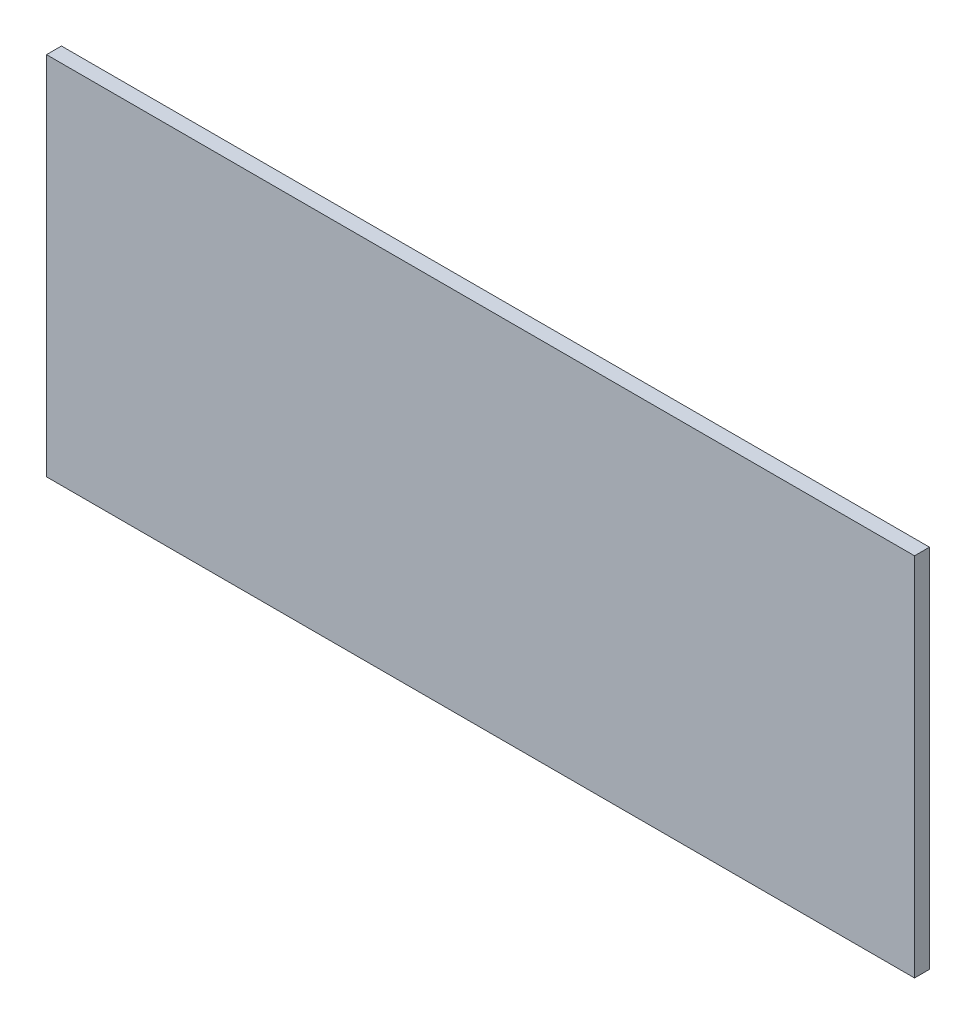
from build123d import *

# Parameters (mm, degrees)
ESQUISSE1_W        = 580
ESQUISSE1_H        = 244.31
BOSS_EXTRU_1_DEPTH = 10


with BuildPart() as part:
    # Esquisse1 → Boss.-Extru.1 (new body)
    with BuildSketch(Plane.XY):
        with Locations((185.861137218, -111.267125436)):
            Rectangle(ESQUISSE1_W, ESQUISSE1_H)
    extrude(amount=BOSS_EXTRU_1_DEPTH)


solid = part.part
